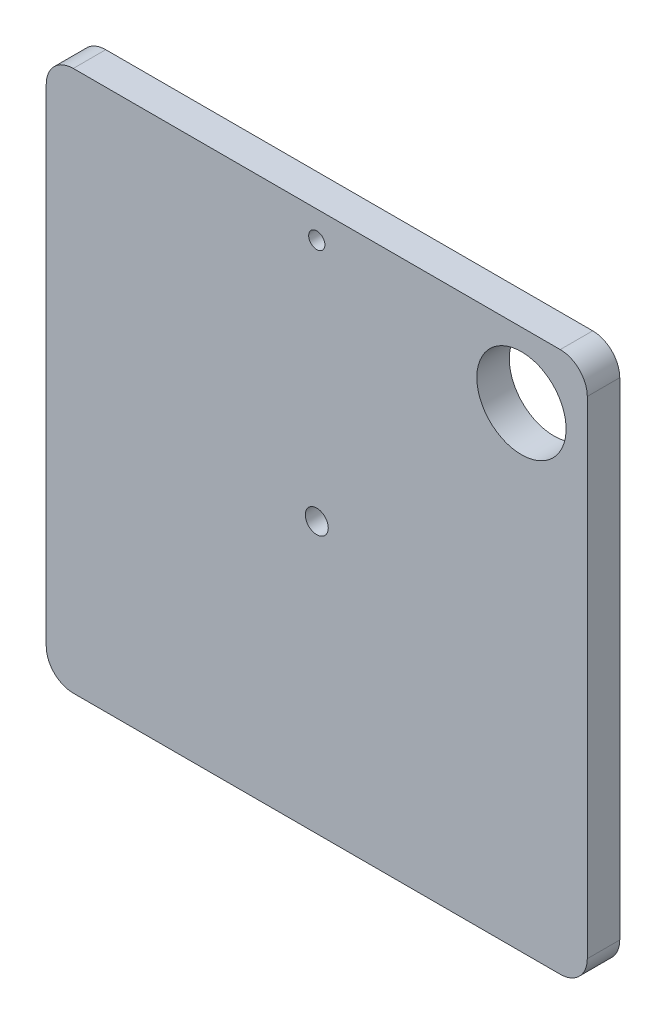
from build123d import *

# Parameters (mm, degrees)
ESQUISSE1_W             = 200
ESQUISSE1_H             = 200
ESQUISSE1_R             = 3
ESQUISSE1_R_2           = 4.25
BOSS_EXTRU_2_DEPTH      = 12
ESQUISSE3_R             = 16.5
ENL_V_MAT_EXTRU_2_DEPTH = 284.097156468
CONG_1_R                = 10


with BuildPart() as part:
    # Esquisse1 → Boss.-Extru.2 (new body)
    with BuildSketch(Plane.XY):
        with Locations((100, -100)):
            Rectangle(ESQUISSE1_W, ESQUISSE1_H)
        with Locations((100, -10)):
            Circle(ESQUISSE1_R, mode=Mode.SUBTRACT)
        with Locations((100, -100)):
            Circle(ESQUISSE1_R_2, mode=Mode.SUBTRACT)
    extrude(amount=BOSS_EXTRU_2_DEPTH)

    # Esquisse3 → Enl_v. mat.-Extru.2 (cut, through all)
    with BuildSketch(Plane(origin=(0, 0, 0), x_dir=(-1, 0, 0), z_dir=(0, 0, -1))):
        with Locations((-175.660425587, -24.339574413)):
            Circle(ESQUISSE3_R)
    extrude(amount=-ENL_V_MAT_EXTRU_2_DEPTH, mode=Mode.SUBTRACT)

    # Cong_1
    cong_1_edges = [part.edges().sort_by_distance(p)[0] for p in [
        (0, 0, 6),
        (200, 0, 6),
        (200, -200, 6),
        (0, -200, 6),
    ]]
    fillet(cong_1_edges, radius=CONG_1_R)


solid = part.part
